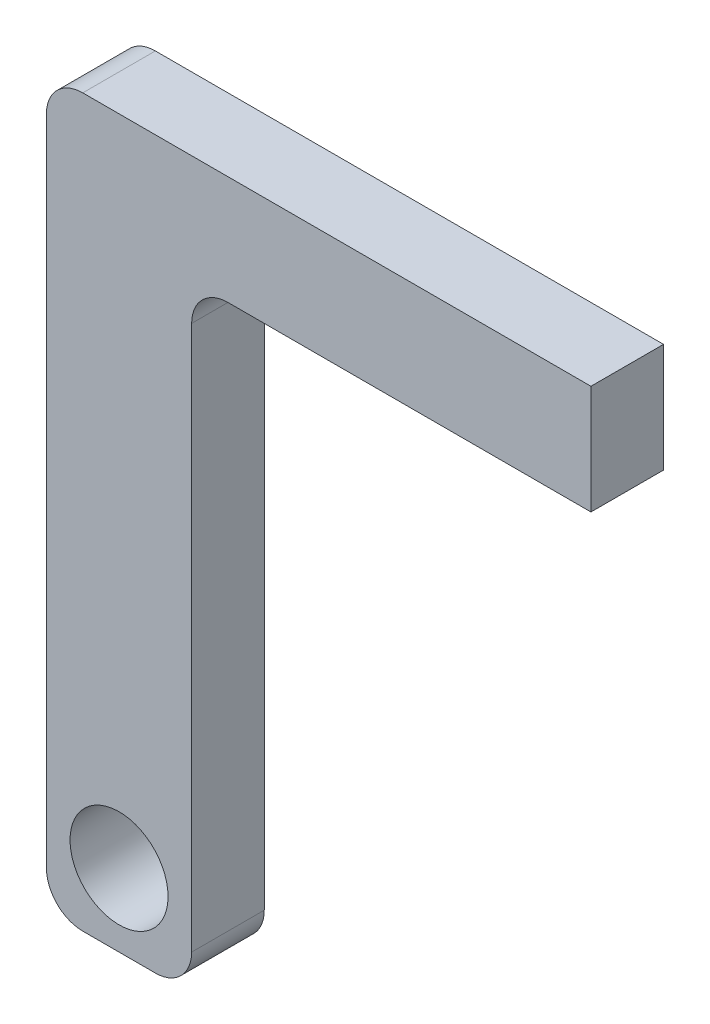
from build123d import *

# Parameters (mm, degrees)
SKETCH1_W           = 40
SKETCH1_H           = 170
BOSS_EXTRUDE1_DEPTH = 20
SKETCH2_W           = 150
SKETCH2_H           = 20
BOSS_EXTRUDE2_DEPTH = 30
FILLET1_R           = 10
CUT_EXTRUDE1_REACH  = 176.714
SKETCH3_R           = 13.5
FILLET2_R           = 10


with BuildPart() as part:
    # Sketch1 → Boss-Extrude1 (new body)
    with BuildSketch(Plane.XY):
        Rectangle(SKETCH1_W, SKETCH1_H)
    extrude(amount=BOSS_EXTRUDE1_DEPTH)

    # Sketch2 → Boss-Extrude2 (add)
    with BuildSketch(Plane(origin=(0, 85, 0), x_dir=(1, 0, 0), z_dir=(0, 1, 0))):
        with Locations((55, -10)):
            Rectangle(SKETCH2_W, SKETCH2_H)
    extrude(amount=BOSS_EXTRUDE2_DEPTH)

    # Fillet1
    fillet1_edges = [part.edges().sort_by_distance(p)[0] for p in [
        (20, -85, 10),
        (-20, -85, 10),
        (-20, 115, 10),
    ]]
    fillet(fillet1_edges, radius=FILLET1_R)

    # Sketch3 → Cut-Extrude1 (cut, up to next)
    with BuildSketch(Plane.XY.offset(20), mode=Mode.PRIVATE) as cut_extrude1_sk1:
        with Locations((0, -65)):
            Circle(SKETCH3_R)
    cut_extrude1_tool1 = extrude(cut_extrude1_sk1.sketch, amount=-CUT_EXTRUDE1_REACH, mode=Mode.PRIVATE) & part.part
    add(cut_extrude1_tool1.solids().sort_by_distance((0, -65, 20))[0], mode=Mode.SUBTRACT)

    # Fillet2
    fillet2_edges = [part.edges().sort_by_distance(p)[0] for p in [
        (20, 85, 10),
    ]]
    fillet(fillet2_edges, radius=FILLET2_R)


solid = part.part
